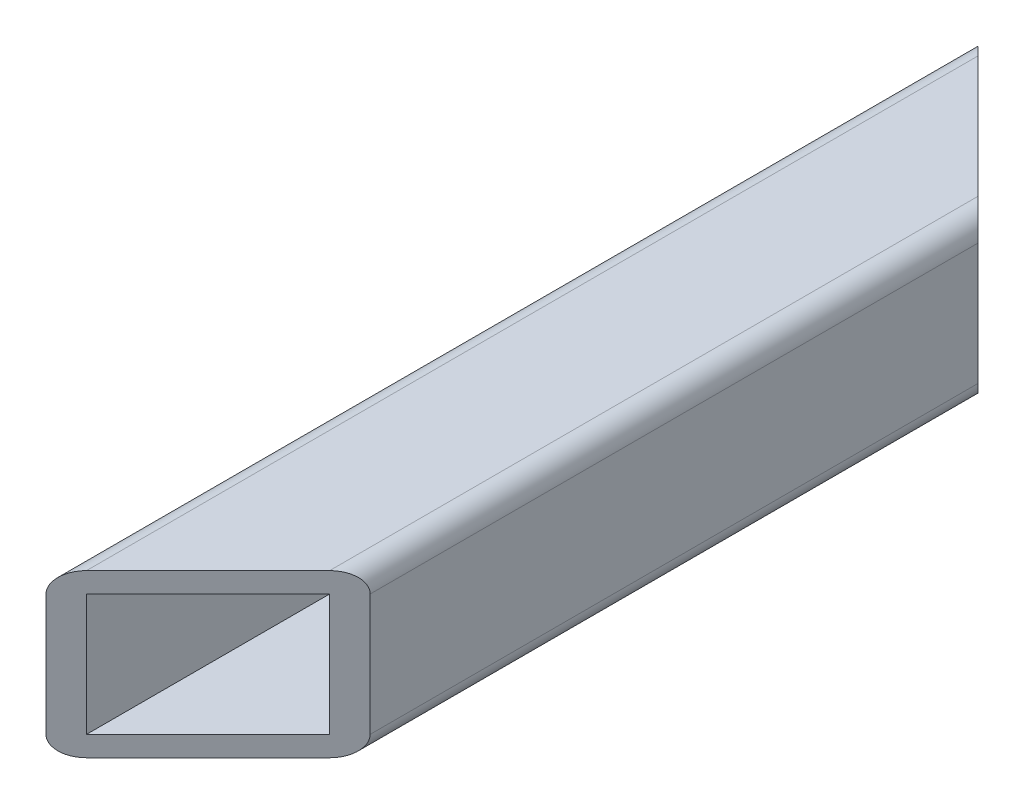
from build123d import *

# Parameters (mm, degrees)
SKETCH1_W           = 38.1
SKETCH1_H           = 38.1
BOSS_EXTRUDE1_DEPTH = 292.1
CUT_EXTRUDE1_DEPTH  = 298.570512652


with BuildPart() as part:
    # Sketch1 → Boss-Extrude1 (new body)
    with BuildSketch(Plane.XY):
        with BuildLine():
            Line((-19.05, -25.4), (19.05, -25.4))
            ThreePointArc((19.05, -25.4), (23.540128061, -23.540128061), (25.4, -19.05))
            Line((25.4, -19.05), (25.4, 19.05))
            ThreePointArc((25.4, 19.05), (23.540128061, 23.540128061), (19.05, 25.4))
            Line((19.05, 25.4), (-19.05, 25.4))
            ThreePointArc((-19.05, 25.4), (-23.540128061, 23.540128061), (-25.4, 19.05))
            Line((-25.4, 19.05), (-25.4, -19.05))
            ThreePointArc((-25.4, -19.05), (-23.540128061, -23.540128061), (-19.05, -25.4))
        make_face()
        Rectangle(SKETCH1_W, SKETCH1_H, mode=Mode.SUBTRACT)
    extrude(amount=-BOSS_EXTRUDE1_DEPTH)

    # Sketch3 → Cut-Extrude1 (cut, through all)
    with BuildSketch(Plane(origin=(0, 25.4, 0), x_dir=(1, 0, 0), z_dir=(0, 1, 0))):
        Polygon((-25.4, 292.1), (25.4, 241.3), (25.4, 292.1), align=None)
        Polygon((-25.4, 0), (25.4, 50.8), (25.4, 0), align=None)
    extrude(amount=-CUT_EXTRUDE1_DEPTH, mode=Mode.SUBTRACT)


solid = part.part
